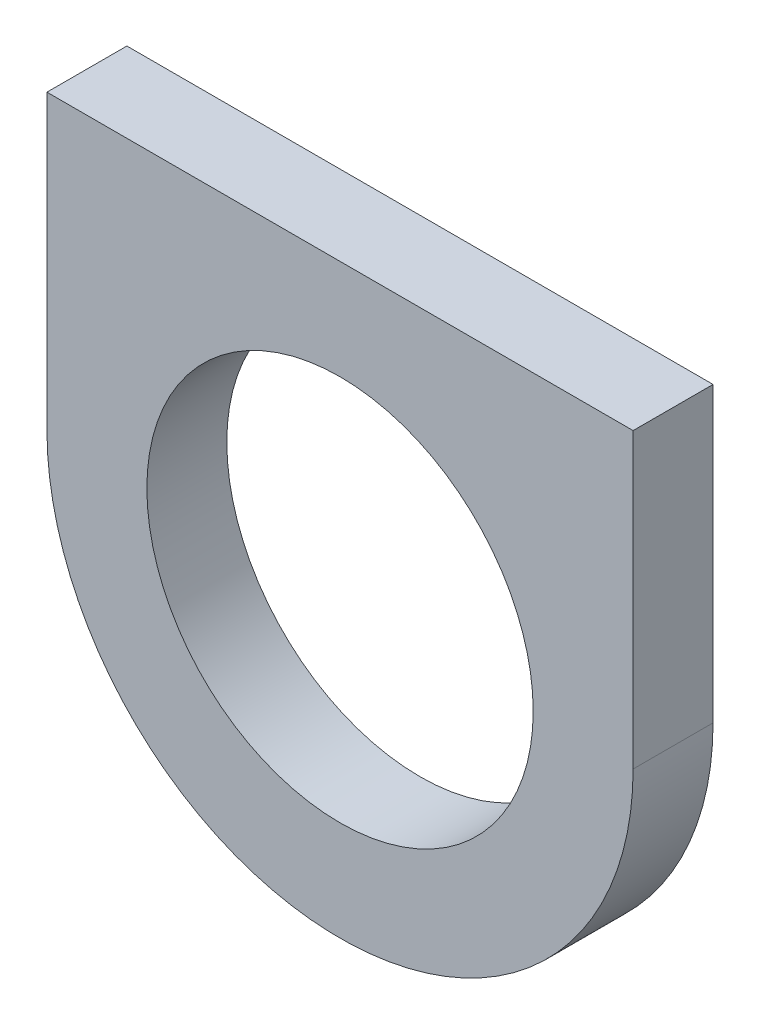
from build123d import *

# Parameters (mm, degrees)
ESQUISSE1_R      = 72.5
EXTRUSION1_DEPTH = 30


with BuildPart() as part:
    # Esquisse1 → Extrusion1 (new body)
    with BuildSketch(Plane.XY):
        with BuildLine():
            Line((110, 0), (110, 110))
            Line((110, 110), (-110, 110))
            Line((-110, 110), (-110, 0))
            ThreePointArc((-110, 0), (0, -110), (110, 0))
        make_face()
        Circle(ESQUISSE1_R, mode=Mode.SUBTRACT)
    extrude(amount=EXTRUSION1_DEPTH)


solid = part.part
